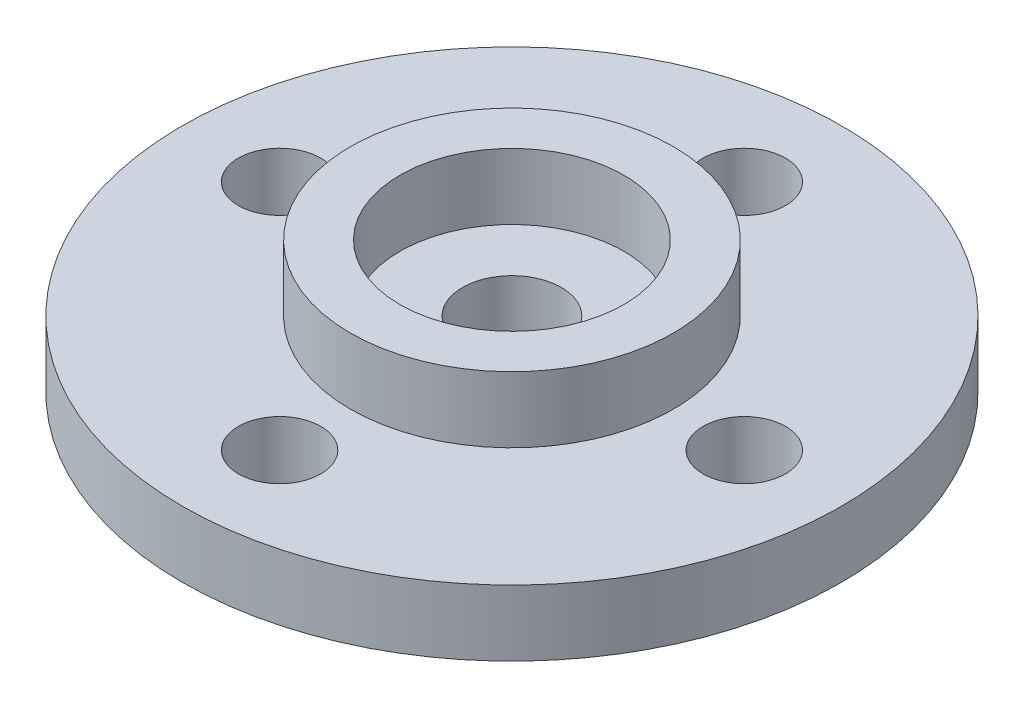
from build123d import *

# Parameters (mm, degrees)
SKETCH_1_R          = 10
EXTRUDE_1_DEPTH     = 2
SKETCH_2_R          = 4.9
SKETCH_2_R_2        = 3.4
EXTRUDE_2_DEPTH     = 2
SKETCH_3_R          = 1.25
CUT_EXTRUDE_1_DEPTH = 2
SKETCH_4_R          = 1.5
CUT_EXTRUDE_2_DEPTH = 2


with BuildPart() as part:
    # Sketch 1 → Extrude 1 (new body)
    with BuildSketch(Plane(origin=(0, 0, 0), x_dir=(1, 0, 0), z_dir=(0, 1, 0))):
        with Locations(Location((0, 0, 0), (0, 0, 270))):
            Circle(SKETCH_1_R)
    extrude(amount=EXTRUDE_1_DEPTH)

    # Sketch 2 → Extrude 2 (add)
    with BuildSketch(Plane(origin=(0, 2, 0), x_dir=(1, 0, 0), z_dir=(0, 1, 0))):
        with Locations(Location((0, 0, 0), (0, 0, 270))):
            Circle(SKETCH_2_R)
        with Locations(Location((0, 0, 0), (0, 0, 270))):
            Circle(SKETCH_2_R_2, mode=Mode.SUBTRACT)
    extrude(amount=EXTRUDE_2_DEPTH)

    # Sketch 3 → Cut-Extrude 1 (cut)
    with BuildSketch(Plane(origin=(0, 2, 0), x_dir=(1, 0, 0), z_dir=(0, 1, 0))):
        with Locations(Location((0, 7.05, 0), (0, 0, 270))):
            Circle(SKETCH_3_R)
        with Locations(Location((7.05, 0, 0), (0, 0, 270))):
            Circle(SKETCH_3_R)
        with Locations(Location((0, -7.05, 0), (0, 0, 270))):
            Circle(SKETCH_3_R)
        with Locations(Location((-7.05, 0, 0), (0, 0, 270))):
            Circle(SKETCH_3_R)
    extrude(amount=-CUT_EXTRUDE_1_DEPTH, mode=Mode.SUBTRACT)

    # Sketch 4 → Cut-Extrude 2 (cut)
    with BuildSketch(Plane(origin=(0, 2, 0), x_dir=(1, 0, 0), z_dir=(0, 1, 0))):
        with Locations(Location((0, 0, 0), (0, 0, 270))):
            Circle(SKETCH_4_R)
    extrude(amount=-CUT_EXTRUDE_2_DEPTH, mode=Mode.SUBTRACT)


solid = part.part
